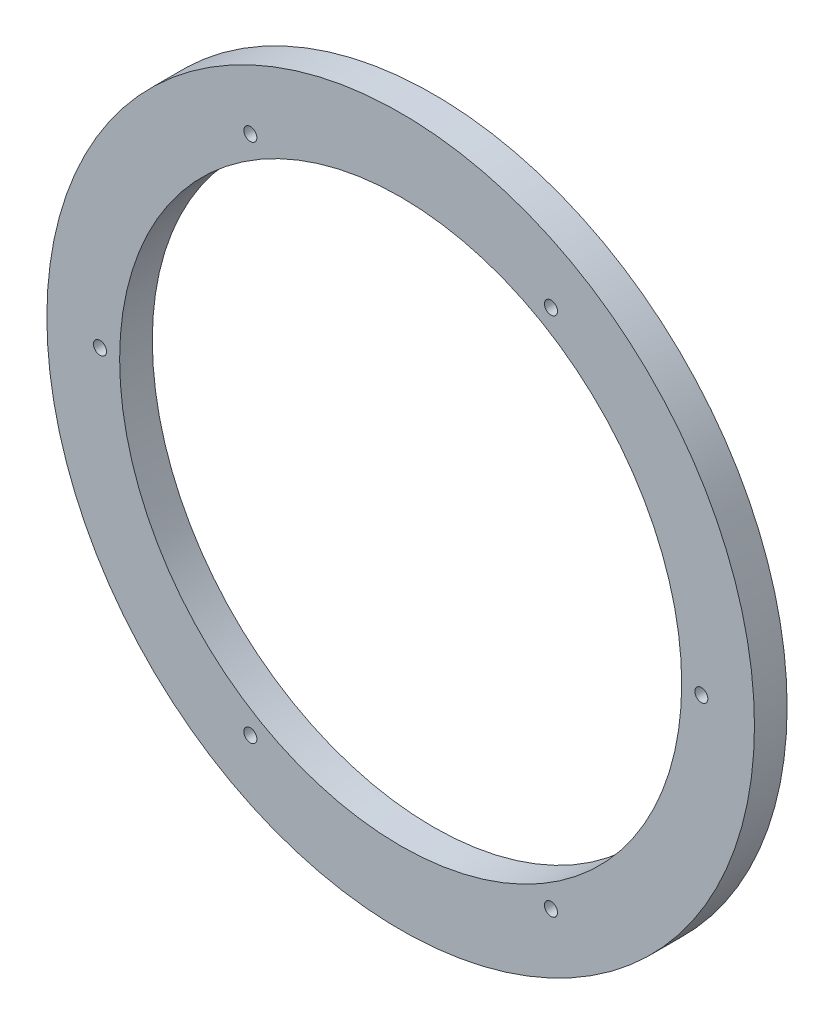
ISO-10303-21;
HEADER;
FILE_DESCRIPTION(('STEP AP214'),'2;1');
FILE_NAME('part.step','',(''),(''),'','','');
FILE_SCHEMA(('AUTOMOTIVE_DESIGN { 1 0 10303 214 1 1 1 1 }'));
ENDSEC;
DATA;
#1=APPLICATION_CONTEXT('core data for automotive mechanical design processes');
#2=APPLICATION_PROTOCOL_DEFINITION('international standard','automotive_design',2000,#1);
#3=PRODUCT_CONTEXT('',#1,'mechanical');
#4=PRODUCT('Part','Part','',(#3));
#5=PRODUCT_RELATED_PRODUCT_CATEGORY('part','',(#4));
#6=PRODUCT_DEFINITION_FORMATION('','',#4);
#7=PRODUCT_DEFINITION_CONTEXT('part definition',#1,'design');
#8=PRODUCT_DEFINITION('design','',#6,#7);
#9=PRODUCT_DEFINITION_SHAPE('','',#8);
#10=(LENGTH_UNIT() NAMED_UNIT(*) SI_UNIT(.MILLI.,.METRE.));
#11=(NAMED_UNIT(*) PLANE_ANGLE_UNIT() SI_UNIT($,.RADIAN.));
#12=(NAMED_UNIT(*) SI_UNIT($,.STERADIAN.) SOLID_ANGLE_UNIT());
#13=UNCERTAINTY_MEASURE_WITH_UNIT(LENGTH_MEASURE(1.E-05),#10,'distance_accuracy_value','');
#14=(GEOMETRIC_REPRESENTATION_CONTEXT(3) GLOBAL_UNCERTAINTY_ASSIGNED_CONTEXT((#13)) GLOBAL_UNIT_ASSIGNED_CONTEXT((#10,
#11,#12)) REPRESENTATION_CONTEXT('',''));
#15=CARTESIAN_POINT('',(0.,0.,0.));
#16=DIRECTION('',(0.,0.,1.));
#17=DIRECTION('',(1.,0.,0.));
#18=AXIS2_PLACEMENT_3D('',#15,#16,#17);
#19=CARTESIAN_POINT('',(0.,0.,-9.525));
#20=DIRECTION('',(0.,0.,1.));
#21=DIRECTION('',(1.,0.,0.));
#22=AXIS2_PLACEMENT_3D('',#19,#20,#21);
#23=CYLINDRICAL_SURFACE('',#22,103.124);
#24=CARTESIAN_POINT('',(0.,0.,-9.525));
#25=DIRECTION('',(0.,0.,1.));
#26=DIRECTION('',(1.,0.,0.));
#27=AXIS2_PLACEMENT_3D('',#24,#25,#26);
#28=CIRCLE('',#27,103.124);
#29=CARTESIAN_POINT('',(103.124,0.,-9.525));
#30=VERTEX_POINT('',#29);
#31=EDGE_CURVE('E10',#30,#30,#28,.T.);
#32=ORIENTED_EDGE('',*,*,#31,.T.);
#33=EDGE_LOOP('',(#32));
#34=FACE_BOUND('',#33,.T.);
#35=CARTESIAN_POINT('',(0.,0.,0.));
#36=DIRECTION('',(0.,0.,1.));
#37=DIRECTION('',(1.,0.,0.));
#38=AXIS2_PLACEMENT_3D('',#35,#36,#37);
#39=CIRCLE('',#38,103.124);
#40=CARTESIAN_POINT('',(103.124,0.,0.));
#41=VERTEX_POINT('',#40);
#42=EDGE_CURVE('E48',#41,#41,#39,.T.);
#43=ORIENTED_EDGE('',*,*,#42,.F.);
#44=EDGE_LOOP('',(#43));
#45=FACE_BOUND('',#44,.T.);
#46=ADVANCED_FACE('F45',(#34,#45),#23,.T.);
#47=CARTESIAN_POINT('',(0.,0.,-9.525));
#48=DIRECTION('',(0.,0.,1.));
#49=DIRECTION('',(1.,0.,0.));
#50=AXIS2_PLACEMENT_3D('',#47,#48,#49);
#51=PLANE('',#50);
#52=CARTESIAN_POINT('',(-87.63,0.,-9.525));
#53=DIRECTION('',(0.,0.,1.));
#54=DIRECTION('',(1.,0.,0.));
#55=AXIS2_PLACEMENT_3D('',#52,#53,#54);
#56=CIRCLE('',#55,1.89865);
#57=CARTESIAN_POINT('',(-85.73135,0.,-9.525));
#58=VERTEX_POINT('',#57);
#59=EDGE_CURVE('E107',#58,#58,#56,.T.);
#60=ORIENTED_EDGE('',*,*,#59,.T.);
#61=EDGE_LOOP('',(#60));
#62=FACE_BOUND('',#61,.T.);
#63=CARTESIAN_POINT('',(-43.8145,75.8906721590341,-9.525));
#64=DIRECTION('',(0.,0.,1.));
#65=DIRECTION('',(1.,0.,0.));
#66=AXIS2_PLACEMENT_3D('',#63,#64,#65);
#67=CIRCLE('',#66,1.89864999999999);
#68=CARTESIAN_POINT('',(-41.91585,75.8906721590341,-9.525));
#69=VERTEX_POINT('',#68);
#70=EDGE_CURVE('E99',#69,#69,#67,.T.);
#71=ORIENTED_EDGE('',*,*,#70,.T.);
#72=EDGE_LOOP('',(#71));
#73=FACE_BOUND('',#72,.T.);
#74=CARTESIAN_POINT('',(43.8165,75.8906721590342,-9.525));
#75=DIRECTION('',(0.,0.,1.));
#76=DIRECTION('',(1.,0.,0.));
#77=AXIS2_PLACEMENT_3D('',#74,#75,#76);
#78=CIRCLE('',#77,1.89864999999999);
#79=CARTESIAN_POINT('',(45.71515,75.8906721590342,-9.525));
#80=VERTEX_POINT('',#79);
#81=EDGE_CURVE('E91',#80,#80,#78,.T.);
#82=ORIENTED_EDGE('',*,*,#81,.T.);
#83=EDGE_LOOP('',(#82));
#84=FACE_BOUND('',#83,.T.);
#85=CARTESIAN_POINT('',(87.632,0.,-9.525));
#86=DIRECTION('',(0.,0.,1.));
#87=DIRECTION('',(1.,0.,0.));
#88=AXIS2_PLACEMENT_3D('',#85,#86,#87);
#89=CIRCLE('',#88,1.89865);
#90=CARTESIAN_POINT('',(89.53065,0.,-9.525));
#91=VERTEX_POINT('',#90);
#92=EDGE_CURVE('E83',#91,#91,#89,.T.);
#93=ORIENTED_EDGE('',*,*,#92,.T.);
#94=EDGE_LOOP('',(#93));
#95=FACE_BOUND('',#94,.T.);
#96=CARTESIAN_POINT('',(43.8165,-75.8906721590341,-9.525));
#97=DIRECTION('',(0.,0.,1.));
#98=DIRECTION('',(1.,0.,0.));
#99=AXIS2_PLACEMENT_3D('',#96,#97,#98);
#100=CIRCLE('',#99,1.89864999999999);
#101=CARTESIAN_POINT('',(45.71515,-75.8906721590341,-9.525));
#102=VERTEX_POINT('',#101);
#103=EDGE_CURVE('E75',#102,#102,#100,.T.);
#104=ORIENTED_EDGE('',*,*,#103,.T.);
#105=EDGE_LOOP('',(#104));
#106=FACE_BOUND('',#105,.T.);
#107=CARTESIAN_POINT('',(-43.8145,-75.8906721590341,-9.525));
#108=DIRECTION('',(0.,0.,1.));
#109=DIRECTION('',(1.,0.,0.));
#110=AXIS2_PLACEMENT_3D('',#107,#108,#109);
#111=CIRCLE('',#110,1.89864999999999);
#112=CARTESIAN_POINT('',(-41.91585,-75.8906721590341,-9.525));
#113=VERTEX_POINT('',#112);
#114=EDGE_CURVE('E64',#113,#113,#111,.T.);
#115=ORIENTED_EDGE('',*,*,#114,.T.);
#116=EDGE_LOOP('',(#115));
#117=FACE_BOUND('',#116,.T.);
#118=CARTESIAN_POINT('',(0.,0.,-9.525));
#119=DIRECTION('',(0.,0.,1.));
#120=DIRECTION('',(1.,0.,0.));
#121=AXIS2_PLACEMENT_3D('',#118,#119,#120);
#122=CIRCLE('',#121,81.915);
#123=CARTESIAN_POINT('',(81.915,0.,-9.525));
#124=VERTEX_POINT('',#123);
#125=EDGE_CURVE('E58',#124,#124,#122,.T.);
#126=ORIENTED_EDGE('',*,*,#125,.T.);
#127=EDGE_LOOP('',(#126));
#128=FACE_BOUND('',#127,.T.);
#129=ORIENTED_EDGE('',*,*,#31,.F.);
#130=EDGE_LOOP('',(#129));
#131=FACE_BOUND('',#130,.T.);
#132=ADVANCED_FACE('F123',(#62,#73,#84,#95,#106,#117,#128,#131),#51,.F.);
#133=CARTESIAN_POINT('',(0.,0.,0.));
#134=DIRECTION('',(0.,0.,1.));
#135=DIRECTION('',(1.,0.,0.));
#136=AXIS2_PLACEMENT_3D('',#133,#134,#135);
#137=PLANE('',#136);
#138=CARTESIAN_POINT('',(-87.63,0.,0.));
#139=DIRECTION('',(0.,0.,1.));
#140=DIRECTION('',(1.,0.,0.));
#141=AXIS2_PLACEMENT_3D('',#138,#139,#140);
#142=CIRCLE('',#141,1.89864999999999);
#143=CARTESIAN_POINT('',(-85.73135,0.,0.));
#144=VERTEX_POINT('',#143);
#145=EDGE_CURVE('E111',#144,#144,#142,.T.);
#146=ORIENTED_EDGE('',*,*,#145,.F.);
#147=EDGE_LOOP('',(#146));
#148=FACE_BOUND('',#147,.T.);
#149=CARTESIAN_POINT('',(-43.8145,75.8906721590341,0.));
#150=DIRECTION('',(0.,0.,1.));
#151=DIRECTION('',(1.,0.,0.));
#152=AXIS2_PLACEMENT_3D('',#149,#150,#151);
#153=CIRCLE('',#152,1.89864999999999);
#154=CARTESIAN_POINT('',(-41.91585,75.8906721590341,0.));
#155=VERTEX_POINT('',#154);
#156=EDGE_CURVE('E103',#155,#155,#153,.T.);
#157=ORIENTED_EDGE('',*,*,#156,.F.);
#158=EDGE_LOOP('',(#157));
#159=FACE_BOUND('',#158,.T.);
#160=CARTESIAN_POINT('',(43.8165,75.8906721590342,0.));
#161=DIRECTION('',(0.,0.,1.));
#162=DIRECTION('',(1.,0.,0.));
#163=AXIS2_PLACEMENT_3D('',#160,#161,#162);
#164=CIRCLE('',#163,1.89864999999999);
#165=CARTESIAN_POINT('',(45.71515,75.8906721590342,0.));
#166=VERTEX_POINT('',#165);
#167=EDGE_CURVE('E95',#166,#166,#164,.T.);
#168=ORIENTED_EDGE('',*,*,#167,.F.);
#169=EDGE_LOOP('',(#168));
#170=FACE_BOUND('',#169,.T.);
#171=CARTESIAN_POINT('',(87.632,0.,0.));
#172=DIRECTION('',(0.,0.,1.));
#173=DIRECTION('',(1.,0.,0.));
#174=AXIS2_PLACEMENT_3D('',#171,#172,#173);
#175=CIRCLE('',#174,1.89864999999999);
#176=CARTESIAN_POINT('',(89.53065,0.,0.));
#177=VERTEX_POINT('',#176);
#178=EDGE_CURVE('E87',#177,#177,#175,.T.);
#179=ORIENTED_EDGE('',*,*,#178,.F.);
#180=EDGE_LOOP('',(#179));
#181=FACE_BOUND('',#180,.T.);
#182=CARTESIAN_POINT('',(43.8165,-75.8906721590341,0.));
#183=DIRECTION('',(0.,0.,1.));
#184=DIRECTION('',(1.,0.,0.));
#185=AXIS2_PLACEMENT_3D('',#182,#183,#184);
#186=CIRCLE('',#185,1.89864999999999);
#187=CARTESIAN_POINT('',(45.71515,-75.8906721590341,0.));
#188=VERTEX_POINT('',#187);
#189=EDGE_CURVE('E79',#188,#188,#186,.T.);
#190=ORIENTED_EDGE('',*,*,#189,.F.);
#191=EDGE_LOOP('',(#190));
#192=FACE_BOUND('',#191,.T.);
#193=CARTESIAN_POINT('',(-43.8145,-75.8906721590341,0.));
#194=DIRECTION('',(0.,0.,1.));
#195=DIRECTION('',(1.,0.,0.));
#196=AXIS2_PLACEMENT_3D('',#193,#194,#195);
#197=CIRCLE('',#196,1.89864999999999);
#198=CARTESIAN_POINT('',(-41.91585,-75.8906721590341,0.));
#199=VERTEX_POINT('',#198);
#200=EDGE_CURVE('E71',#199,#199,#197,.T.);
#201=ORIENTED_EDGE('',*,*,#200,.F.);
#202=EDGE_LOOP('',(#201));
#203=FACE_BOUND('',#202,.T.);
#204=CARTESIAN_POINT('',(0.,0.,0.));
#205=DIRECTION('',(0.,0.,1.));
#206=DIRECTION('',(1.,0.,0.));
#207=AXIS2_PLACEMENT_3D('',#204,#205,#206);
#208=CIRCLE('',#207,81.915);
#209=CARTESIAN_POINT('',(81.915,0.,0.));
#210=VERTEX_POINT('',#209);
#211=EDGE_CURVE('E60',#210,#210,#208,.T.);
#212=ORIENTED_EDGE('',*,*,#211,.F.);
#213=EDGE_LOOP('',(#212));
#214=FACE_BOUND('',#213,.T.);
#215=ORIENTED_EDGE('',*,*,#42,.T.);
#216=EDGE_LOOP('',(#215));
#217=FACE_BOUND('',#216,.T.);
#218=ADVANCED_FACE('F119',(#148,#159,#170,#181,#192,#203,#214,#217),#137,.T.);
#219=CARTESIAN_POINT('',(0.,0.,-9.525));
#220=DIRECTION('',(0.,0.,1.));
#221=DIRECTION('',(1.,0.,0.));
#222=AXIS2_PLACEMENT_3D('',#219,#220,#221);
#223=CYLINDRICAL_SURFACE('',#222,81.915);
#224=ORIENTED_EDGE('',*,*,#125,.F.);
#225=EDGE_LOOP('',(#224));
#226=FACE_BOUND('',#225,.T.);
#227=ORIENTED_EDGE('',*,*,#211,.T.);
#228=EDGE_LOOP('',(#227));
#229=FACE_BOUND('',#228,.T.);
#230=ADVANCED_FACE('F122',(#226,#229),#223,.F.);
#231=CARTESIAN_POINT('',(-43.8145,-75.8906721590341,0.));
#232=DIRECTION('',(0.,0.,1.));
#233=DIRECTION('',(1.,0.,0.));
#234=AXIS2_PLACEMENT_3D('',#231,#232,#233);
#235=CYLINDRICAL_SURFACE('',#234,1.89864999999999);
#236=ORIENTED_EDGE('',*,*,#114,.F.);
#237=EDGE_LOOP('',(#236));
#238=FACE_BOUND('',#237,.T.);
#239=ORIENTED_EDGE('',*,*,#200,.T.);
#240=EDGE_LOOP('',(#239));
#241=FACE_BOUND('',#240,.T.);
#242=ADVANCED_FACE('F151',(#238,#241),#235,.F.);
#243=CARTESIAN_POINT('',(43.8165,-75.8906721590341,0.));
#244=DIRECTION('',(0.,0.,1.));
#245=DIRECTION('',(1.,0.,0.));
#246=AXIS2_PLACEMENT_3D('',#243,#244,#245);
#247=CYLINDRICAL_SURFACE('',#246,1.89864999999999);
#248=ORIENTED_EDGE('',*,*,#103,.F.);
#249=EDGE_LOOP('',(#248));
#250=FACE_BOUND('',#249,.T.);
#251=ORIENTED_EDGE('',*,*,#189,.T.);
#252=EDGE_LOOP('',(#251));
#253=FACE_BOUND('',#252,.T.);
#254=ADVANCED_FACE('F155',(#250,#253),#247,.F.);
#255=CARTESIAN_POINT('',(87.632,0.,0.));
#256=DIRECTION('',(0.,0.,1.));
#257=DIRECTION('',(1.,0.,0.));
#258=AXIS2_PLACEMENT_3D('',#255,#256,#257);
#259=CYLINDRICAL_SURFACE('',#258,1.89864999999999);
#260=ORIENTED_EDGE('',*,*,#92,.F.);
#261=EDGE_LOOP('',(#260));
#262=FACE_BOUND('',#261,.T.);
#263=ORIENTED_EDGE('',*,*,#178,.T.);
#264=EDGE_LOOP('',(#263));
#265=FACE_BOUND('',#264,.T.);
#266=ADVANCED_FACE('F159',(#262,#265),#259,.F.);
#267=CARTESIAN_POINT('',(43.8165,75.8906721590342,0.));
#268=DIRECTION('',(0.,0.,1.));
#269=DIRECTION('',(1.,0.,0.));
#270=AXIS2_PLACEMENT_3D('',#267,#268,#269);
#271=CYLINDRICAL_SURFACE('',#270,1.89864999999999);
#272=ORIENTED_EDGE('',*,*,#81,.F.);
#273=EDGE_LOOP('',(#272));
#274=FACE_BOUND('',#273,.T.);
#275=ORIENTED_EDGE('',*,*,#167,.T.);
#276=EDGE_LOOP('',(#275));
#277=FACE_BOUND('',#276,.T.);
#278=ADVANCED_FACE('F163',(#274,#277),#271,.F.);
#279=CARTESIAN_POINT('',(-43.8145,75.8906721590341,0.));
#280=DIRECTION('',(0.,0.,1.));
#281=DIRECTION('',(1.,0.,0.));
#282=AXIS2_PLACEMENT_3D('',#279,#280,#281);
#283=CYLINDRICAL_SURFACE('',#282,1.89864999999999);
#284=ORIENTED_EDGE('',*,*,#70,.F.);
#285=EDGE_LOOP('',(#284));
#286=FACE_BOUND('',#285,.T.);
#287=ORIENTED_EDGE('',*,*,#156,.T.);
#288=EDGE_LOOP('',(#287));
#289=FACE_BOUND('',#288,.T.);
#290=ADVANCED_FACE('F167',(#286,#289),#283,.F.);
#291=CARTESIAN_POINT('',(-87.63,0.,0.));
#292=DIRECTION('',(0.,0.,1.));
#293=DIRECTION('',(1.,0.,0.));
#294=AXIS2_PLACEMENT_3D('',#291,#292,#293);
#295=CYLINDRICAL_SURFACE('',#294,1.89864999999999);
#296=ORIENTED_EDGE('',*,*,#59,.F.);
#297=EDGE_LOOP('',(#296));
#298=FACE_BOUND('',#297,.T.);
#299=ORIENTED_EDGE('',*,*,#145,.T.);
#300=EDGE_LOOP('',(#299));
#301=FACE_BOUND('',#300,.T.);
#302=ADVANCED_FACE('F117',(#298,#301),#295,.F.);
#303=CLOSED_SHELL('',(#46,#132,#218,#230,#242,#254,#266,#278,#290,#302));
#304=MANIFOLD_SOLID_BREP('B2',#303);
#305=ADVANCED_BREP_SHAPE_REPRESENTATION('',(#18,#304),#14);
#306=SHAPE_DEFINITION_REPRESENTATION(#9,#305);
ENDSEC;
END-ISO-10303-21;
